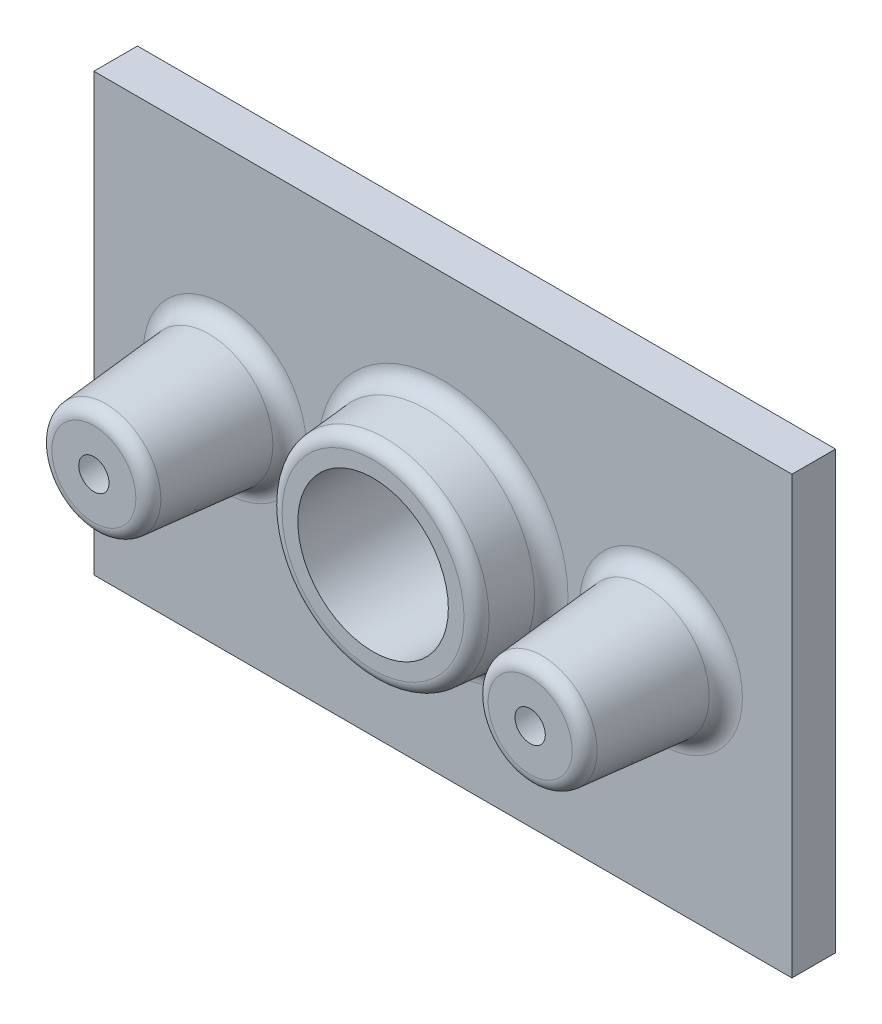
from build123d import *

# Parameters (mm, degrees)
EXTRUSION1_DEPTH           = 5
ESQUISSE2_R                = 12.5
EXTRUSION2_DEPTH           = 8
EXTRUSION2_TAPER           = 5.000000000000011
EXTRUSION3_DEPTH           = 3
EXTRUSION3_TAPER           = 3.0000000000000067
BOSS_EXTRU_2_DEPTH         = 3
ESQUISSE3_R                = 8.625
ENL_V_MAT_EXTRU_1_DEPTH    = 51.85272854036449
ESQUISSE5_R                = 7.499999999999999
EXTRUSION4_DEPTH           = 15
EXTRUSION4_DRAFT           = 5.000000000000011
EXTRUSION4_PROFILE_2_DEPTH = 15
EXTRUSION4_PROFILE_2_DRAFT = 5.000000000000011
CONG_1_R                   = 2
CONG_2_R                   = 1.5
CONG_3_R                   = 2
CHANFREIN1_SIZE            = 0.5


with BuildPart() as part:
    # Esquisse1 → Extrusion1 (new body)
    with BuildSketch(Plane.XY):
        Polygon((-39.99999999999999, 24.999999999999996), (40.00000000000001, 24.999999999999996), (40.00000000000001, -25.000000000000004), (-39.999999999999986, -25), align=None)
    extrude(amount=EXTRUSION1_DEPTH)

    # Esquisse2 → Extrusion2 (add)
    with BuildSketch(Plane.XY.offset(5)):
        Circle(ESQUISSE2_R)
    extrude(amount=EXTRUSION2_DEPTH, taper=EXTRUSION2_TAPER)

    # Esquisse4 → Extrusion3 (add)
    with BuildSketch(Plane(origin=(0, 0, 0), x_dir=(-1, 0, 0), z_dir=(0, 0, -1))):
        with BuildLine():
            ThreePointArc((-28.200000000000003, 7.332121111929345), (-33, 9.8e-16), (-28.2, -7.332121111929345))
            Line((-28.2, -7.332121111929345), (-7.199999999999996, -16.49727250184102))
            ThreePointArc((-7.199999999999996, -16.49727250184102), (1.1e-15, -17.999999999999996), (7.199999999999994, -16.497272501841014))
            Line((7.199999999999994, -16.497272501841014), (28.2, -7.332121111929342))
            ThreePointArc((28.2, -7.332121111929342), (33, 0), (28.2, 7.332121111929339))
            Line((28.2, 7.332121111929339), (7.199999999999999, 16.497272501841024))
            ThreePointArc((7.199999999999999, 16.497272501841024), (1.1e-15, 18), (-7.200000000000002, 16.49727250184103))
            Line((-7.200000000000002, 16.49727250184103), (-28.200000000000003, 7.332121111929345))
        make_face()
    extrude(amount=EXTRUSION3_DEPTH, taper=EXTRUSION3_TAPER)

    # Esquisse11 → Boss.-Extru.2 (add)
    with BuildSketch(Plane(origin=(0, 0, -3), x_dir=(-1, 0, 0), z_dir=(0, 0, -1))):
        with BuildLine():
            Line((-23.53393637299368, 9.197013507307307), (-28.137110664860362, 7.188023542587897))
            ThreePointArc((-28.137110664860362, 7.188023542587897), (-32.842776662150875, -1.66e-15), (-28.137110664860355, -7.188023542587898))
            Line((-28.137110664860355, -7.188023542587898), (-23.53393637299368, -9.1970135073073))
            Line((-23.53393637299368, -9.1970135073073), (-19.1040975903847, -3.784696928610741))
            Line((-19.1040975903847, -3.784696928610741), (-19.1040975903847, 3.784696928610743))
            Line((-19.1040975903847, 3.784696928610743), (-23.53393637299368, 9.197013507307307))
        make_face()
    boss_extru_2 = extrude(amount=BOSS_EXTRU_2_DEPTH)

    # Sym_trie1: Boss.-Extru.2 across plane
    add(boss_extru_2.mirror(Plane(origin=(0, 0, 0), x_dir=(0, 0, 1), z_dir=(1, 0, 0))))

    # Esquisse3 → Enl_v. mat.-Extru.1 (cut, through all)
    with BuildSketch(Plane.XY.offset(13.000000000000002)):
        Circle(ESQUISSE3_R)
    extrude(amount=-ENL_V_MAT_EXTRU_1_DEPTH, mode=Mode.SUBTRACT)


with BuildPart() as extrusion4_tool:
    # Esquisse5 → Extrusion4 (with draft: the straight prism first)
    with BuildSketch(Plane.XY.offset(5)):
        with Locations((-25, 0)):
            Circle(ESQUISSE5_R)
    extrude(amount=EXTRUSION4_DEPTH)
    # Extrusion4: the draft: its side faces are tilted about the plane it starts from
    extrusion4_sides = [extrusion4_tool.faces().sort_by_distance(p)[0] for p in [
        (-32.5, 0, 12.5),
    ]]
    draft(extrusion4_sides, Plane.XY.offset(5), EXTRUSION4_DRAFT)


with BuildPart() as part_1:
    add(part.part)

    # Extrusion4: add extrusion4_tool
    add(extrusion4_tool.part)


with BuildPart() as extrusion4_profile_2_tool:
    # Esquisse5 → Extrusion4 profile 2 (with draft: the straight prism first)
    with BuildSketch(Plane.XY.offset(5)):
        with Locations((25, 0)):
            Circle(ESQUISSE5_R)
    extrude(amount=EXTRUSION4_PROFILE_2_DEPTH)
    # Extrusion4 profile 2: the draft: its side faces are tilted about the plane it starts from
    extrusion4_profile_2_sides = [extrusion4_profile_2_tool.faces().sort_by_distance(p)[0] for p in [
        (17.5, 0, 12.5),
    ]]
    draft(extrusion4_profile_2_sides, Plane.XY.offset(5), EXTRUSION4_PROFILE_2_DRAFT)


with BuildPart() as part_2:
    add(part_1.part)

    # Extrusion4 profile 2: add extrusion4_profile_2_tool
    add(extrusion4_profile_2_tool.part)

    # Cong_1
    cong_1_edges = [part_2.edges().sort_by_distance(p)[0] for p in [
        (-12.499999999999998, 6.4e-16, 5),
        (-32.5, 9.2e-16, 5),
        (17.5, 9.2e-16, 5),
    ]]
    fillet(cong_1_edges, radius=CONG_1_R)

    # Cong_2
    cong_2_edges = [part_2.edges().sort_by_distance(p)[0] for p in [
        (-11.800090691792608, -2.4e-16, 13),
        (-31.187670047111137, 7.6e-16, 20),
        (18.812329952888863, 7.6e-16, 20),
    ]]
    fillet(cong_2_edges, radius=CONG_2_R)

    # Cong_3
    cong_3_edges = [part_2.edges().sort_by_distance(p)[0] for p in [
        (1.55e-15, 18, 0),
        (17.700000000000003, 11.914696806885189, 0),
        (33, -1.33e-15, 0),
        (17.699999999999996, -11.914696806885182, 0),
        (-2.2e-16, -18, 0),
        (-17.699999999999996, -11.914696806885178, 0),
        (-33, -8.9e-16, 0),
        (-17.7, 11.914696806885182, 0),
    ]]
    fillet(cong_3_edges, radius=CONG_3_R)

    # Chanfrein1
    chanfrein1_edges = [part_2.edges().sort_by_distance(p)[0] for p in [
        (-8.625, 1.06e-15, -2.9999999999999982),
    ]]
    chamfer(chanfrein1_edges, length=CHANFREIN1_SIZE)

    # Esquisse12 → Trou taraud_ M81 (revolve, cut)
    with BuildSketch(Plane(origin=(25, 0, -6), x_dir=(0, 1, 0), z_dir=(1, 0, 0))):
        Polygon((0, 0), (-6.62e-15, 27.04292610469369), (3.3999999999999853, 24.999999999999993), (3.3999999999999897, -1.14e-15), align=None)
    trou_taraud_m81 = revolve(axis=Axis((25, 0, -12.34999999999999), (0, 0, 1)), mode=Mode.SUBTRACT)

    # Sym_trie2: Trou taraud_ M81 across plane
    add(trou_taraud_m81.mirror(Plane(origin=(0, 0, 0), x_dir=(0, 0, 1), z_dir=(1, 0, 0))), mode=Mode.SUBTRACT)


solid = part_2.part
